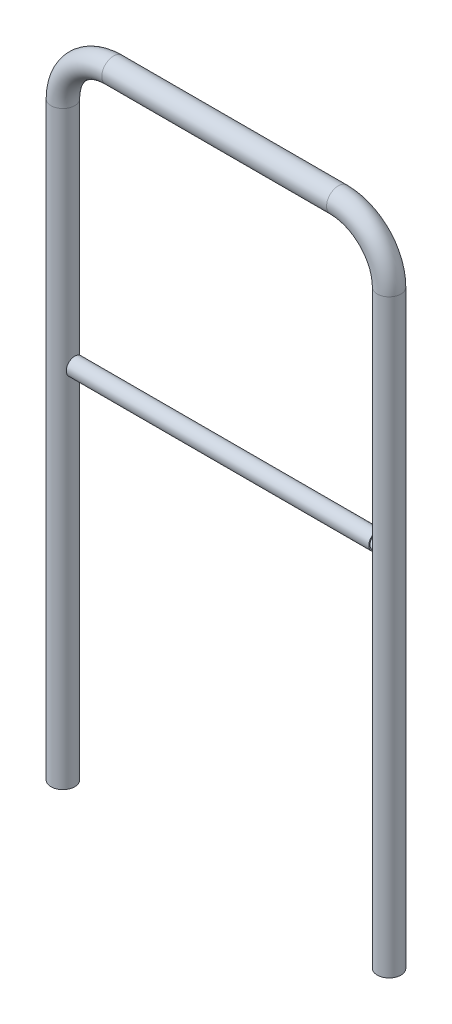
ISO-10303-21;
HEADER;
FILE_DESCRIPTION(('STEP AP214'),'2;1');
FILE_NAME('part.step','',(''),(''),'','','');
FILE_SCHEMA(('AUTOMOTIVE_DESIGN { 1 0 10303 214 1 1 1 1 }'));
ENDSEC;
DATA;
#1=APPLICATION_CONTEXT('core data for automotive mechanical design processes');
#2=APPLICATION_PROTOCOL_DEFINITION('international standard','automotive_design',2000,#1);
#3=PRODUCT_CONTEXT('',#1,'mechanical');
#4=PRODUCT('Part','Part','',(#3));
#5=PRODUCT_RELATED_PRODUCT_CATEGORY('part','',(#4));
#6=PRODUCT_DEFINITION_FORMATION('','',#4);
#7=PRODUCT_DEFINITION_CONTEXT('part definition',#1,'design');
#8=PRODUCT_DEFINITION('design','',#6,#7);
#9=PRODUCT_DEFINITION_SHAPE('','',#8);
#10=(LENGTH_UNIT() NAMED_UNIT(*) SI_UNIT(.MILLI.,.METRE.));
#11=(NAMED_UNIT(*) PLANE_ANGLE_UNIT() SI_UNIT($,.RADIAN.));
#12=(NAMED_UNIT(*) SI_UNIT($,.STERADIAN.) SOLID_ANGLE_UNIT());
#13=UNCERTAINTY_MEASURE_WITH_UNIT(LENGTH_MEASURE(1.E-05),#10,'distance_accuracy_value','');
#14=(GEOMETRIC_REPRESENTATION_CONTEXT(3) GLOBAL_UNCERTAINTY_ASSIGNED_CONTEXT((#13)) GLOBAL_UNIT_ASSIGNED_CONTEXT((#10,
#11,#12)) REPRESENTATION_CONTEXT('',''));
#15=CARTESIAN_POINT('',(0.,0.,0.));
#16=DIRECTION('',(0.,0.,1.));
#17=DIRECTION('',(1.,0.,0.));
#18=AXIS2_PLACEMENT_3D('',#15,#16,#17);
#19=CARTESIAN_POINT('',(0.,647.,0.));
#20=DIRECTION('',(-1.,0.,0.));
#21=DIRECTION('',(0.,0.,1.));
#22=AXIS2_PLACEMENT_3D('',#19,#20,#21);
#23=CYLINDRICAL_SURFACE('',#22,13.);
#24=CARTESIAN_POINT('',(-558.000000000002,647.,0.));
#25=DIRECTION('',(1.,0.,0.));
#26=DIRECTION('',(0.,1.,0.));
#27=AXIS2_PLACEMENT_3D('',#24,#25,#26);
#28=CIRCLE('',#27,13.);
#29=CARTESIAN_POINT('',(-558.000000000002,660.,0.));
#30=VERTEX_POINT('',#29);
#31=EDGE_CURVE('E48',#30,#30,#28,.T.);
#32=ORIENTED_EDGE('',*,*,#31,.F.);
#33=EDGE_LOOP('',(#32));
#34=FACE_BOUND('',#33,.T.);
#35=CARTESIAN_POINT('',(-21.,647.,0.));
#36=DIRECTION('',(1.,0.,0.));
#37=DIRECTION('',(0.,1.,0.));
#38=AXIS2_PLACEMENT_3D('',#35,#36,#37);
#39=CIRCLE('',#38,13.);
#40=CARTESIAN_POINT('',(-21.,660.,0.));
#41=VERTEX_POINT('',#40);
#42=EDGE_CURVE('E57',#41,#41,#39,.T.);
#43=ORIENTED_EDGE('',*,*,#42,.T.);
#44=EDGE_LOOP('',(#43));
#45=FACE_BOUND('',#44,.T.);
#46=ADVANCED_FACE('F42',(#34,#45),#23,.F.);
#47=CARTESIAN_POINT('',(0.,647.,0.));
#48=DIRECTION('',(-1.,0.,0.));
#49=DIRECTION('',(0.,0.,1.));
#50=AXIS2_PLACEMENT_3D('',#47,#48,#49);
#51=CYLINDRICAL_SURFACE('',#50,15.);
#52=CARTESIAN_POINT('',(-558.000000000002,647.,0.));
#53=DIRECTION('',(1.,0.,0.));
#54=DIRECTION('',(0.,1.,0.));
#55=AXIS2_PLACEMENT_3D('',#52,#53,#54);
#56=CIRCLE('',#55,15.);
#57=CARTESIAN_POINT('',(-558.000000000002,662.,0.));
#58=VERTEX_POINT('',#57);
#59=EDGE_CURVE('E52',#58,#58,#56,.T.);
#60=ORIENTED_EDGE('',*,*,#59,.T.);
#61=EDGE_LOOP('',(#60));
#62=FACE_BOUND('',#61,.T.);
#63=CARTESIAN_POINT('',(-21.,647.,0.));
#64=DIRECTION('',(1.,0.,0.));
#65=DIRECTION('',(0.,1.,0.));
#66=AXIS2_PLACEMENT_3D('',#63,#64,#65);
#67=CIRCLE('',#66,15.);
#68=CARTESIAN_POINT('',(-21.,662.,0.));
#69=VERTEX_POINT('',#68);
#70=EDGE_CURVE('E11',#69,#69,#67,.T.);
#71=ORIENTED_EDGE('',*,*,#70,.F.);
#72=EDGE_LOOP('',(#71));
#73=FACE_BOUND('',#72,.T.);
#74=ADVANCED_FACE('F70',(#62,#73),#51,.T.);
#75=CARTESIAN_POINT('',(-558.000000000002,1158.,1666.46810553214));
#76=DIRECTION('',(1.,0.,0.));
#77=DIRECTION('',(0.,1.,0.));
#78=AXIS2_PLACEMENT_3D('',#75,#76,#77);
#79=PLANE('',#78);
#80=ORIENTED_EDGE('',*,*,#31,.T.);
#81=EDGE_LOOP('',(#80));
#82=FACE_BOUND('',#81,.T.);
#83=ORIENTED_EDGE('',*,*,#59,.F.);
#84=EDGE_LOOP('',(#83));
#85=FACE_BOUND('',#84,.T.);
#86=ADVANCED_FACE('F65',(#82,#85),#79,.F.);
#87=CARTESIAN_POINT('',(-21.0000000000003,1158.,1666.46810553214));
#88=DIRECTION('',(1.,0.,0.));
#89=DIRECTION('',(0.,1.,0.));
#90=AXIS2_PLACEMENT_3D('',#87,#88,#89);
#91=PLANE('',#90);
#92=ORIENTED_EDGE('',*,*,#42,.F.);
#93=EDGE_LOOP('',(#92));
#94=FACE_BOUND('',#93,.T.);
#95=ORIENTED_EDGE('',*,*,#70,.T.);
#96=EDGE_LOOP('',(#95));
#97=FACE_BOUND('',#96,.T.);
#98=ADVANCED_FACE('F63',(#94,#97),#91,.T.);
#99=CLOSED_SHELL('',(#46,#74,#86,#98));
#100=MANIFOLD_SOLID_BREP('B2',#99);
#101=CARTESIAN_POINT('',(-579.000000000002,1047.,0.));
#102=DIRECTION('',(0.,-1.,0.));
#103=DIRECTION('',(1.,0.,0.));
#104=AXIS2_PLACEMENT_3D('',#101,#102,#103);
#105=CYLINDRICAL_SURFACE('',#104,18.5);
#106=CARTESIAN_POINT('',(-579.000000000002,1047.,0.));
#107=DIRECTION('',(0.,1.,0.));
#108=DIRECTION('',(0.,0.,1.));
#109=AXIS2_PLACEMENT_3D('',#106,#107,#108);
#110=CIRCLE('',#109,18.5);
#111=CARTESIAN_POINT('',(-597.500000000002,1047.,0.));
#112=VERTEX_POINT('',#111);
#113=EDGE_CURVE('E126',#112,#112,#110,.T.);
#114=ORIENTED_EDGE('',*,*,#113,.T.);
#115=EDGE_LOOP('',(#114));
#116=FACE_BOUND('',#115,.T.);
#117=CARTESIAN_POINT('',(-579.000000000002,0.,0.));
#118=DIRECTION('',(0.,1.,0.));
#119=DIRECTION('',(0.,0.,1.));
#120=AXIS2_PLACEMENT_3D('',#117,#118,#119);
#121=CIRCLE('',#120,18.5);
#122=CARTESIAN_POINT('',(-579.000000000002,0.,18.5));
#123=VERTEX_POINT('',#122);
#124=EDGE_CURVE('E118',#123,#123,#121,.T.);
#125=ORIENTED_EDGE('',*,*,#124,.F.);
#126=EDGE_LOOP('',(#125));
#127=FACE_BOUND('',#126,.T.);
#128=ADVANCED_FACE('F107',(#116,#127),#105,.F.);
#129=CARTESIAN_POINT('',(-579.000000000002,1047.,0.));
#130=DIRECTION('',(0.,-1.,0.));
#131=DIRECTION('',(1.,0.,0.));
#132=AXIS2_PLACEMENT_3D('',#129,#130,#131);
#133=CYLINDRICAL_SURFACE('',#132,21.);
#134=CARTESIAN_POINT('',(-579.000000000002,1047.,0.));
#135=DIRECTION('',(0.,1.,0.));
#136=DIRECTION('',(0.,0.,1.));
#137=AXIS2_PLACEMENT_3D('',#134,#135,#136);
#138=CIRCLE('',#137,21.);
#139=CARTESIAN_POINT('',(-600.000000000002,1047.,0.));
#140=VERTEX_POINT('',#139);
#141=EDGE_CURVE('E41',#140,#140,#138,.T.);
#142=ORIENTED_EDGE('',*,*,#141,.F.);
#143=EDGE_LOOP('',(#142));
#144=FACE_BOUND('',#143,.T.);
#145=CARTESIAN_POINT('',(-579.000000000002,0.,0.));
#146=DIRECTION('',(0.,1.,0.));
#147=DIRECTION('',(0.,0.,1.));
#148=AXIS2_PLACEMENT_3D('',#145,#146,#147);
#149=CIRCLE('',#148,21.);
#150=CARTESIAN_POINT('',(-579.000000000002,0.,21.));
#151=VERTEX_POINT('',#150);
#152=EDGE_CURVE('E110',#151,#151,#149,.T.);
#153=ORIENTED_EDGE('',*,*,#152,.T.);
#154=EDGE_LOOP('',(#153));
#155=FACE_BOUND('',#154,.T.);
#156=ADVANCED_FACE('F191',(#144,#155),#133,.T.);
#157=CARTESIAN_POINT('',(-579.000000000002,0.,0.));
#158=DIRECTION('',(0.,1.,0.));
#159=DIRECTION('',(0.,0.,1.));
#160=AXIS2_PLACEMENT_3D('',#157,#158,#159);
#161=PLANE('',#160);
#162=ORIENTED_EDGE('',*,*,#124,.T.);
#163=EDGE_LOOP('',(#162));
#164=FACE_BOUND('',#163,.T.);
#165=ORIENTED_EDGE('',*,*,#152,.F.);
#166=EDGE_LOOP('',(#165));
#167=FACE_BOUND('',#166,.T.);
#168=ADVANCED_FACE('F195',(#164,#167),#161,.F.);
#169=CARTESIAN_POINT('',(-489.000000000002,1047.,0.));
#170=DIRECTION('',(0.,0.,1.));
#171=DIRECTION('',(1.,0.,0.));
#172=AXIS2_PLACEMENT_3D('',#169,#170,#171);
#173=TOROIDAL_SURFACE('',#172,89.9999999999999,18.5);
#174=CARTESIAN_POINT('',(-489.000000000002,1137.,0.));
#175=DIRECTION('',(1.,0.,0.));
#176=DIRECTION('',(0.,0.,1.));
#177=AXIS2_PLACEMENT_3D('',#174,#175,#176);
#178=CIRCLE('',#177,18.5);
#179=CARTESIAN_POINT('',(-489.000000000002,1155.5,0.));
#180=VERTEX_POINT('',#179);
#181=EDGE_CURVE('E134',#180,#180,#178,.T.);
#182=CARTESIAN_POINT('',(-489.000000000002,1047.,0.));
#183=DIRECTION('',(0.,0.,1.));
#184=DIRECTION('',(1.,0.,0.));
#185=AXIS2_PLACEMENT_3D('',#182,#183,#184);
#186=CIRCLE('',#185,108.5);
#187=EDGE_CURVE('',#180,#112,#186,.T.);
#188=ORIENTED_EDGE('',*,*,#181,.T.);
#189=ORIENTED_EDGE('',*,*,#113,.F.);
#190=ORIENTED_EDGE('',*,*,#187,.T.);
#191=ORIENTED_EDGE('',*,*,#187,.F.);
#192=EDGE_LOOP('',(#188,#190,#189,#191));
#193=FACE_BOUND('',#192,.T.);
#194=ADVANCED_FACE('F201',(#193),#173,.F.);
#195=CARTESIAN_POINT('',(-489.000000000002,1047.,0.));
#196=DIRECTION('',(0.,0.,1.));
#197=DIRECTION('',(1.,0.,0.));
#198=AXIS2_PLACEMENT_3D('',#195,#196,#197);
#199=TOROIDAL_SURFACE('',#198,89.9999999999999,21.);
#200=CARTESIAN_POINT('',(-489.000000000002,1137.,0.));
#201=DIRECTION('',(1.,0.,0.));
#202=DIRECTION('',(0.,0.,1.));
#203=AXIS2_PLACEMENT_3D('',#200,#201,#202);
#204=CIRCLE('',#203,21.);
#205=CARTESIAN_POINT('',(-489.000000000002,1158.,0.));
#206=VERTEX_POINT('',#205);
#207=EDGE_CURVE('E120',#206,#206,#204,.T.);
#208=CARTESIAN_POINT('',(-489.000000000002,1047.,0.));
#209=DIRECTION('',(0.,0.,1.));
#210=DIRECTION('',(1.,0.,0.));
#211=AXIS2_PLACEMENT_3D('',#208,#209,#210);
#212=CIRCLE('',#211,111.);
#213=EDGE_CURVE('',#206,#140,#212,.T.);
#214=ORIENTED_EDGE('',*,*,#207,.F.);
#215=ORIENTED_EDGE('',*,*,#141,.T.);
#216=ORIENTED_EDGE('',*,*,#213,.T.);
#217=ORIENTED_EDGE('',*,*,#213,.F.);
#218=EDGE_LOOP('',(#214,#216,#215,#217));
#219=FACE_BOUND('',#218,.T.);
#220=ADVANCED_FACE('F187',(#219),#199,.T.);
#221=CARTESIAN_POINT('',(-90.,1137.,0.));
#222=DIRECTION('',(-1.,0.,0.));
#223=DIRECTION('',(0.,0.,1.));
#224=AXIS2_PLACEMENT_3D('',#221,#222,#223);
#225=CYLINDRICAL_SURFACE('',#224,18.5);
#226=CARTESIAN_POINT('',(-90.,1137.,0.));
#227=DIRECTION('',(1.,0.,0.));
#228=DIRECTION('',(0.,0.,1.));
#229=AXIS2_PLACEMENT_3D('',#226,#227,#228);
#230=CIRCLE('',#229,18.5);
#231=CARTESIAN_POINT('',(-90.,1155.5,0.));
#232=VERTEX_POINT('',#231);
#233=EDGE_CURVE('E142',#232,#232,#230,.T.);
#234=ORIENTED_EDGE('',*,*,#233,.T.);
#235=EDGE_LOOP('',(#234));
#236=FACE_BOUND('',#235,.T.);
#237=ORIENTED_EDGE('',*,*,#181,.F.);
#238=EDGE_LOOP('',(#237));
#239=FACE_BOUND('',#238,.T.);
#240=ADVANCED_FACE('F179',(#236,#239),#225,.F.);
#241=CARTESIAN_POINT('',(-90.,1137.,0.));
#242=DIRECTION('',(-1.,0.,0.));
#243=DIRECTION('',(0.,0.,1.));
#244=AXIS2_PLACEMENT_3D('',#241,#242,#243);
#245=CYLINDRICAL_SURFACE('',#244,21.);
#246=CARTESIAN_POINT('',(-90.,1137.,0.));
#247=DIRECTION('',(1.,0.,0.));
#248=DIRECTION('',(0.,0.,1.));
#249=AXIS2_PLACEMENT_3D('',#246,#247,#248);
#250=CIRCLE('',#249,21.);
#251=CARTESIAN_POINT('',(-90.,1158.,0.));
#252=VERTEX_POINT('',#251);
#253=EDGE_CURVE('E130',#252,#252,#250,.T.);
#254=ORIENTED_EDGE('',*,*,#253,.F.);
#255=EDGE_LOOP('',(#254));
#256=FACE_BOUND('',#255,.T.);
#257=ORIENTED_EDGE('',*,*,#207,.T.);
#258=EDGE_LOOP('',(#257));
#259=FACE_BOUND('',#258,.T.);
#260=ADVANCED_FACE('F177',(#256,#259),#245,.T.);
#261=CARTESIAN_POINT('',(-90.,1047.,0.));
#262=DIRECTION('',(0.,0.,1.));
#263=DIRECTION('',(1.,0.,0.));
#264=AXIS2_PLACEMENT_3D('',#261,#262,#263);
#265=TOROIDAL_SURFACE('',#264,90.,18.5);
#266=CARTESIAN_POINT('',(-1.11022302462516E-13,1047.,0.));
#267=DIRECTION('',(0.,-1.,0.));
#268=DIRECTION('',(0.,0.,1.));
#269=AXIS2_PLACEMENT_3D('',#266,#267,#268);
#270=CIRCLE('',#269,18.5);
#271=CARTESIAN_POINT('',(18.5,1047.,0.));
#272=VERTEX_POINT('',#271);
#273=EDGE_CURVE('E146',#272,#272,#270,.T.);
#274=CARTESIAN_POINT('',(-90.,1047.,0.));
#275=DIRECTION('',(0.,0.,1.));
#276=DIRECTION('',(1.,0.,0.));
#277=AXIS2_PLACEMENT_3D('',#274,#275,#276);
#278=CIRCLE('',#277,108.5);
#279=EDGE_CURVE('',#272,#232,#278,.T.);
#280=ORIENTED_EDGE('',*,*,#273,.T.);
#281=ORIENTED_EDGE('',*,*,#233,.F.);
#282=ORIENTED_EDGE('',*,*,#279,.T.);
#283=ORIENTED_EDGE('',*,*,#279,.F.);
#284=EDGE_LOOP('',(#280,#282,#281,#283));
#285=FACE_BOUND('',#284,.T.);
#286=ADVANCED_FACE('F173',(#285),#265,.F.);
#287=CARTESIAN_POINT('',(-90.,1047.,0.));
#288=DIRECTION('',(0.,0.,1.));
#289=DIRECTION('',(1.,0.,0.));
#290=AXIS2_PLACEMENT_3D('',#287,#288,#289);
#291=TOROIDAL_SURFACE('',#290,90.,21.);
#292=CARTESIAN_POINT('',(0.,1047.,0.));
#293=DIRECTION('',(0.,-1.,0.));
#294=DIRECTION('',(0.,0.,1.));
#295=AXIS2_PLACEMENT_3D('',#292,#293,#294);
#296=CIRCLE('',#295,21.);
#297=CARTESIAN_POINT('',(21.,1047.,0.));
#298=VERTEX_POINT('',#297);
#299=EDGE_CURVE('E138',#298,#298,#296,.T.);
#300=CARTESIAN_POINT('',(-90.,1047.,0.));
#301=DIRECTION('',(0.,0.,1.));
#302=DIRECTION('',(1.,0.,0.));
#303=AXIS2_PLACEMENT_3D('',#300,#301,#302);
#304=CIRCLE('',#303,111.);
#305=EDGE_CURVE('',#298,#252,#304,.T.);
#306=ORIENTED_EDGE('',*,*,#299,.F.);
#307=ORIENTED_EDGE('',*,*,#253,.T.);
#308=ORIENTED_EDGE('',*,*,#305,.T.);
#309=ORIENTED_EDGE('',*,*,#305,.F.);
#310=EDGE_LOOP('',(#306,#308,#307,#309));
#311=FACE_BOUND('',#310,.T.);
#312=ADVANCED_FACE('F170',(#311),#291,.T.);
#313=CARTESIAN_POINT('',(0.,0.,0.));
#314=DIRECTION('',(0.,1.,0.));
#315=DIRECTION('',(-1.,0.,0.));
#316=AXIS2_PLACEMENT_3D('',#313,#314,#315);
#317=CYLINDRICAL_SURFACE('',#316,18.5);
#318=CARTESIAN_POINT('',(0.,0.,0.));
#319=DIRECTION('',(0.,-1.,0.));
#320=DIRECTION('',(0.,0.,1.));
#321=AXIS2_PLACEMENT_3D('',#318,#319,#320);
#322=CIRCLE('',#321,18.5);
#323=CARTESIAN_POINT('',(0.,0.,18.5));
#324=VERTEX_POINT('',#323);
#325=EDGE_CURVE('E149',#324,#324,#322,.T.);
#326=ORIENTED_EDGE('',*,*,#325,.T.);
#327=EDGE_LOOP('',(#326));
#328=FACE_BOUND('',#327,.T.);
#329=ORIENTED_EDGE('',*,*,#273,.F.);
#330=EDGE_LOOP('',(#329));
#331=FACE_BOUND('',#330,.T.);
#332=ADVANCED_FACE('F155',(#328,#331),#317,.F.);
#333=CARTESIAN_POINT('',(0.,0.,0.));
#334=DIRECTION('',(0.,1.,0.));
#335=DIRECTION('',(-1.,0.,0.));
#336=AXIS2_PLACEMENT_3D('',#333,#334,#335);
#337=CYLINDRICAL_SURFACE('',#336,21.);
#338=CARTESIAN_POINT('',(0.,0.,0.));
#339=DIRECTION('',(0.,-1.,0.));
#340=DIRECTION('',(0.,0.,1.));
#341=AXIS2_PLACEMENT_3D('',#338,#339,#340);
#342=CIRCLE('',#341,21.);
#343=CARTESIAN_POINT('',(0.,0.,21.));
#344=VERTEX_POINT('',#343);
#345=EDGE_CURVE('E145',#344,#344,#342,.T.);
#346=ORIENTED_EDGE('',*,*,#345,.F.);
#347=EDGE_LOOP('',(#346));
#348=FACE_BOUND('',#347,.T.);
#349=ORIENTED_EDGE('',*,*,#299,.T.);
#350=EDGE_LOOP('',(#349));
#351=FACE_BOUND('',#350,.T.);
#352=ADVANCED_FACE('F161',(#348,#351),#337,.T.);
#353=CARTESIAN_POINT('',(0.,0.,0.));
#354=DIRECTION('',(0.,-1.,0.));
#355=DIRECTION('',(0.,0.,1.));
#356=AXIS2_PLACEMENT_3D('',#353,#354,#355);
#357=PLANE('',#356);
#358=ORIENTED_EDGE('',*,*,#325,.F.);
#359=EDGE_LOOP('',(#358));
#360=FACE_BOUND('',#359,.T.);
#361=ORIENTED_EDGE('',*,*,#345,.T.);
#362=EDGE_LOOP('',(#361));
#363=FACE_BOUND('',#362,.T.);
#364=ADVANCED_FACE('F158',(#360,#363),#357,.T.);
#365=CLOSED_SHELL('',(#128,#156,#168,#194,#220,#240,#260,#286,#312,#332,#352,#364));
#366=MANIFOLD_SOLID_BREP('B6',#365);
#367=ADVANCED_BREP_SHAPE_REPRESENTATION('',(#18,#100,#366),#14);
#368=SHAPE_DEFINITION_REPRESENTATION(#9,#367);
ENDSEC;
END-ISO-10303-21;
